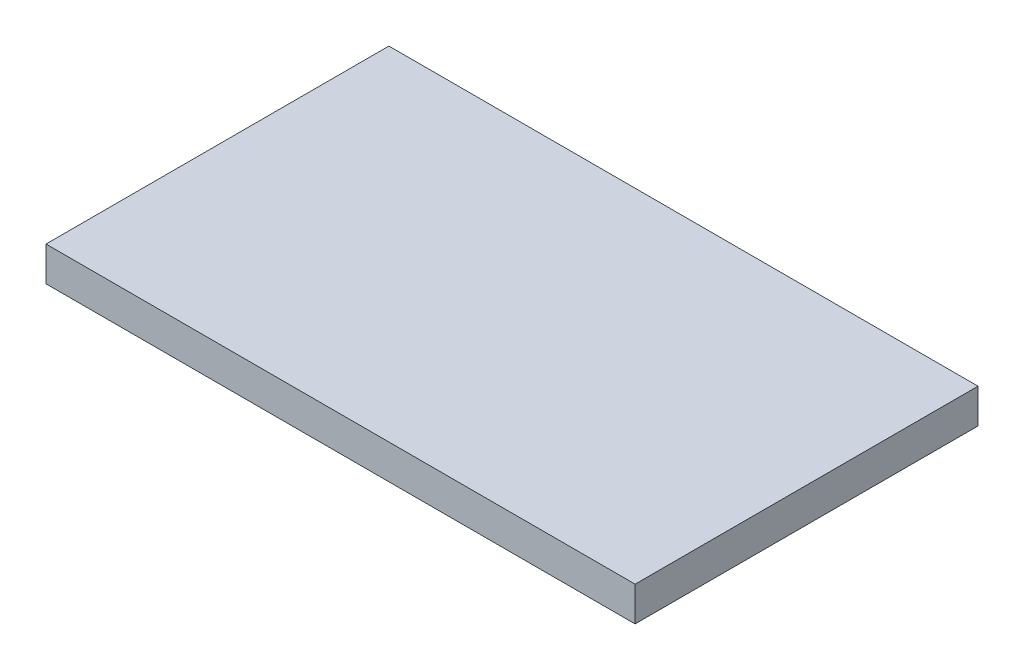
from build123d import *

# Parameters (mm, degrees)
SKETCH1_W      = 170.93145917
SKETCH1_H      = 99.491834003
EXTRUDE1_DEPTH = 10


with BuildPart() as part:
    # Sketch1 → Extrude1 (new body)
    with BuildSketch(Plane(origin=(0, 0, 0), x_dir=(1, 0, 0), z_dir=(0, 1, 0))):
        with Locations((1.870147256, 2.057161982)):
            Rectangle(SKETCH1_W, SKETCH1_H)
    extrude(amount=EXTRUDE1_DEPTH)


solid = part.part
